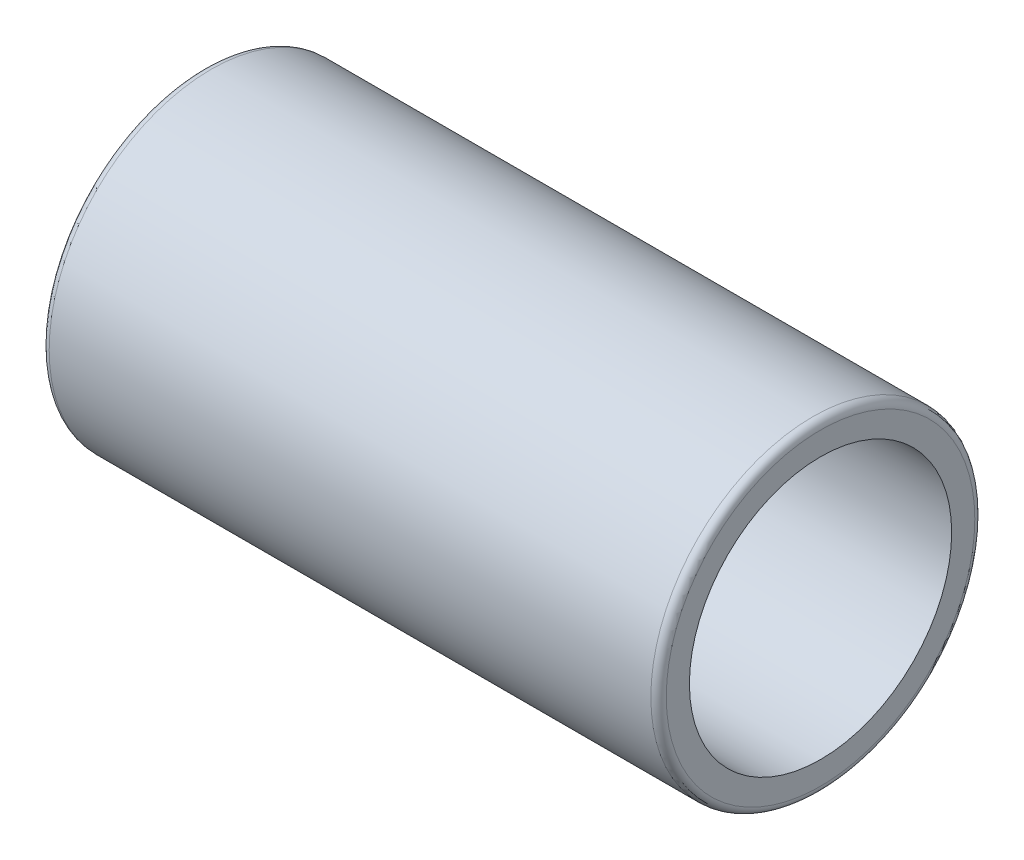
ISO-10303-21;
HEADER;
FILE_DESCRIPTION(('STEP AP214'),'2;1');
FILE_NAME('part.step','',(''),(''),'','','');
FILE_SCHEMA(('AUTOMOTIVE_DESIGN { 1 0 10303 214 1 1 1 1 }'));
ENDSEC;
DATA;
#1=APPLICATION_CONTEXT('core data for automotive mechanical design processes');
#2=APPLICATION_PROTOCOL_DEFINITION('international standard','automotive_design',2000,#1);
#3=PRODUCT_CONTEXT('',#1,'mechanical');
#4=PRODUCT('Part','Part','',(#3));
#5=PRODUCT_RELATED_PRODUCT_CATEGORY('part','',(#4));
#6=PRODUCT_DEFINITION_FORMATION('','',#4);
#7=PRODUCT_DEFINITION_CONTEXT('part definition',#1,'design');
#8=PRODUCT_DEFINITION('design','',#6,#7);
#9=PRODUCT_DEFINITION_SHAPE('','',#8);
#10=(LENGTH_UNIT() NAMED_UNIT(*) SI_UNIT(.MILLI.,.METRE.));
#11=(NAMED_UNIT(*) PLANE_ANGLE_UNIT() SI_UNIT($,.RADIAN.));
#12=(NAMED_UNIT(*) SI_UNIT($,.STERADIAN.) SOLID_ANGLE_UNIT());
#13=UNCERTAINTY_MEASURE_WITH_UNIT(LENGTH_MEASURE(1.E-05),#10,'distance_accuracy_value','');
#14=(GEOMETRIC_REPRESENTATION_CONTEXT(3) GLOBAL_UNCERTAINTY_ASSIGNED_CONTEXT((#13)) GLOBAL_UNIT_ASSIGNED_CONTEXT((#10,
#11,#12)) REPRESENTATION_CONTEXT('',''));
#15=CARTESIAN_POINT('',(0.,0.,0.));
#16=DIRECTION('',(0.,0.,1.));
#17=DIRECTION('',(1.,0.,0.));
#18=AXIS2_PLACEMENT_3D('',#15,#16,#17);
#19=CARTESIAN_POINT('',(0.,0.,0.));
#20=DIRECTION('',(-1.,0.,0.));
#21=DIRECTION('',(0.,0.,1.));
#22=AXIS2_PLACEMENT_3D('',#19,#20,#21);
#23=CYLINDRICAL_SURFACE('',#22,6.);
#24=CARTESIAN_POINT('',(1.99999999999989,0.,0.));
#25=DIRECTION('',(-1.,0.,0.));
#26=DIRECTION('',(0.,0.,1.));
#27=AXIS2_PLACEMENT_3D('',#24,#25,#26);
#28=CIRCLE('',#27,6.);
#29=CARTESIAN_POINT('',(1.99999999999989,0.,6.));
#30=VERTEX_POINT('',#29);
#31=EDGE_CURVE('E43',#30,#30,#28,.T.);
#32=ORIENTED_EDGE('',*,*,#31,.F.);
#33=EDGE_LOOP('',(#32));
#34=FACE_BOUND('',#33,.T.);
#35=CARTESIAN_POINT('',(0.,0.,0.));
#36=DIRECTION('',(-1.,0.,0.));
#37=DIRECTION('',(0.,0.,1.));
#38=AXIS2_PLACEMENT_3D('',#35,#36,#37);
#39=CIRCLE('',#38,6.);
#40=CARTESIAN_POINT('',(0.,0.,6.));
#41=VERTEX_POINT('',#40);
#42=EDGE_CURVE('E34',#41,#41,#39,.T.);
#43=ORIENTED_EDGE('',*,*,#42,.T.);
#44=EDGE_LOOP('',(#43));
#45=FACE_BOUND('',#44,.T.);
#46=ADVANCED_FACE('F14',(#34,#45),#23,.F.);
#47=CARTESIAN_POINT('',(0.,6.,0.));
#48=DIRECTION('',(1.,0.,0.));
#49=DIRECTION('',(0.,0.,-1.));
#50=AXIS2_PLACEMENT_3D('',#47,#48,#49);
#51=PLANE('',#50);
#52=CARTESIAN_POINT('',(0.,0.,0.));
#53=DIRECTION('',(1.,0.,0.));
#54=DIRECTION('',(0.,0.,-1.));
#55=AXIS2_PLACEMENT_3D('',#52,#53,#54);
#56=CIRCLE('',#55,20.);
#57=CARTESIAN_POINT('',(0.,0.,-20.));
#58=VERTEX_POINT('',#57);
#59=EDGE_CURVE('E21',#58,#58,#56,.F.);
#60=ORIENTED_EDGE('',*,*,#59,.T.);
#61=EDGE_LOOP('',(#60));
#62=FACE_BOUND('',#61,.T.);
#63=ORIENTED_EDGE('',*,*,#42,.F.);
#64=EDGE_LOOP('',(#63));
#65=FACE_BOUND('',#64,.T.);
#66=ADVANCED_FACE('F51',(#62,#65),#51,.F.);
#67=CARTESIAN_POINT('',(0.,0.,0.));
#68=DIRECTION('',(-1.,0.,0.));
#69=DIRECTION('',(0.,0.,1.));
#70=AXIS2_PLACEMENT_3D('',#67,#68,#69);
#71=CYLINDRICAL_SURFACE('',#70,21.);
#72=CARTESIAN_POINT('',(1.,0.,0.));
#73=DIRECTION('',(1.,0.,0.));
#74=DIRECTION('',(0.,0.,-1.));
#75=AXIS2_PLACEMENT_3D('',#72,#73,#74);
#76=CIRCLE('',#75,21.);
#77=CARTESIAN_POINT('',(1.,0.,-21.));
#78=VERTEX_POINT('',#77);
#79=EDGE_CURVE('E9',#78,#78,#76,.T.);
#80=ORIENTED_EDGE('',*,*,#79,.T.);
#81=EDGE_LOOP('',(#80));
#82=FACE_BOUND('',#81,.T.);
#83=CARTESIAN_POINT('',(79.,0.,0.));
#84=DIRECTION('',(-1.,0.,0.));
#85=DIRECTION('',(0.,0.,1.));
#86=AXIS2_PLACEMENT_3D('',#83,#84,#85);
#87=CIRCLE('',#86,21.);
#88=CARTESIAN_POINT('',(79.,0.,21.));
#89=VERTEX_POINT('',#88);
#90=EDGE_CURVE('E29',#89,#89,#87,.T.);
#91=ORIENTED_EDGE('',*,*,#90,.T.);
#92=EDGE_LOOP('',(#91));
#93=FACE_BOUND('',#92,.T.);
#94=ADVANCED_FACE('F56',(#82,#93),#71,.T.);
#95=CARTESIAN_POINT('',(80.,21.,0.));
#96=DIRECTION('',(-1.,0.,0.));
#97=DIRECTION('',(0.,0.,1.));
#98=AXIS2_PLACEMENT_3D('',#95,#96,#97);
#99=PLANE('',#98);
#100=CARTESIAN_POINT('',(80.,0.,0.));
#101=DIRECTION('',(-1.,0.,0.));
#102=DIRECTION('',(0.,0.,1.));
#103=AXIS2_PLACEMENT_3D('',#100,#101,#102);
#104=CIRCLE('',#103,20.);
#105=CARTESIAN_POINT('',(80.,0.,20.));
#106=VERTEX_POINT('',#105);
#107=EDGE_CURVE('E25',#106,#106,#104,.F.);
#108=ORIENTED_EDGE('',*,*,#107,.T.);
#109=EDGE_LOOP('',(#108));
#110=FACE_BOUND('',#109,.T.);
#111=CARTESIAN_POINT('',(80.,0.,0.));
#112=DIRECTION('',(-1.,0.,0.));
#113=DIRECTION('',(0.,0.,1.));
#114=AXIS2_PLACEMENT_3D('',#111,#112,#113);
#115=CIRCLE('',#114,17.);
#116=CARTESIAN_POINT('',(80.,0.,17.));
#117=VERTEX_POINT('',#116);
#118=EDGE_CURVE('E37',#117,#117,#115,.T.);
#119=ORIENTED_EDGE('',*,*,#118,.T.);
#120=EDGE_LOOP('',(#119));
#121=FACE_BOUND('',#120,.T.);
#122=ADVANCED_FACE('F63',(#110,#121),#99,.F.);
#123=CARTESIAN_POINT('',(0.,0.,0.));
#124=DIRECTION('',(-1.,0.,0.));
#125=DIRECTION('',(0.,0.,1.));
#126=AXIS2_PLACEMENT_3D('',#123,#124,#125);
#127=CYLINDRICAL_SURFACE('',#126,17.);
#128=ORIENTED_EDGE('',*,*,#118,.F.);
#129=EDGE_LOOP('',(#128));
#130=FACE_BOUND('',#129,.T.);
#131=CARTESIAN_POINT('',(13.,0.,0.));
#132=DIRECTION('',(-1.,0.,0.));
#133=DIRECTION('',(0.,0.,1.));
#134=AXIS2_PLACEMENT_3D('',#131,#132,#133);
#135=CIRCLE('',#134,17.);
#136=CARTESIAN_POINT('',(13.,0.,17.));
#137=VERTEX_POINT('',#136);
#138=EDGE_CURVE('E40',#137,#137,#135,.T.);
#139=ORIENTED_EDGE('',*,*,#138,.T.);
#140=EDGE_LOOP('',(#139));
#141=FACE_BOUND('',#140,.T.);
#142=ADVANCED_FACE('F75',(#130,#141),#127,.F.);
#143=CARTESIAN_POINT('',(1.99999999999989,0.,0.));
#144=DIRECTION('',(1.,0.,0.));
#145=DIRECTION('',(0.,0.,-1.));
#146=AXIS2_PLACEMENT_3D('',#143,#144,#145);
#147=CONICAL_SURFACE('',#146,6.,0.785398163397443);
#148=ORIENTED_EDGE('',*,*,#138,.F.);
#149=EDGE_LOOP('',(#148));
#150=FACE_BOUND('',#149,.T.);
#151=ORIENTED_EDGE('',*,*,#31,.T.);
#152=EDGE_LOOP('',(#151));
#153=FACE_BOUND('',#152,.T.);
#154=ADVANCED_FACE('F47',(#150,#153),#147,.F.);
#155=CARTESIAN_POINT('',(79.,0.,0.));
#156=DIRECTION('',(-1.,0.,0.));
#157=DIRECTION('',(0.,0.,1.));
#158=AXIS2_PLACEMENT_3D('',#155,#156,#157);
#159=TOROIDAL_SURFACE('',#158,20.,1.);
#160=ORIENTED_EDGE('',*,*,#107,.F.);
#161=EDGE_LOOP('',(#160));
#162=FACE_BOUND('',#161,.T.);
#163=ORIENTED_EDGE('',*,*,#90,.F.);
#164=EDGE_LOOP('',(#163));
#165=FACE_BOUND('',#164,.T.);
#166=ADVANCED_FACE('F66',(#162,#165),#159,.T.);
#167=CARTESIAN_POINT('',(1.,0.,0.));
#168=DIRECTION('',(1.,0.,0.));
#169=DIRECTION('',(0.,0.,-1.));
#170=AXIS2_PLACEMENT_3D('',#167,#168,#169);
#171=TOROIDAL_SURFACE('',#170,20.,1.);
#172=ORIENTED_EDGE('',*,*,#79,.F.);
#173=EDGE_LOOP('',(#172));
#174=FACE_BOUND('',#173,.T.);
#175=ORIENTED_EDGE('',*,*,#59,.F.);
#176=EDGE_LOOP('',(#175));
#177=FACE_BOUND('',#176,.T.);
#178=ADVANCED_FACE('F16',(#174,#177),#171,.T.);
#179=CLOSED_SHELL('',(#46,#66,#94,#122,#142,#154,#166,#178));
#180=MANIFOLD_SOLID_BREP('B1',#179);
#181=ADVANCED_BREP_SHAPE_REPRESENTATION('',(#18,#180),#14);
#182=SHAPE_DEFINITION_REPRESENTATION(#9,#181);
ENDSEC;
END-ISO-10303-21;
